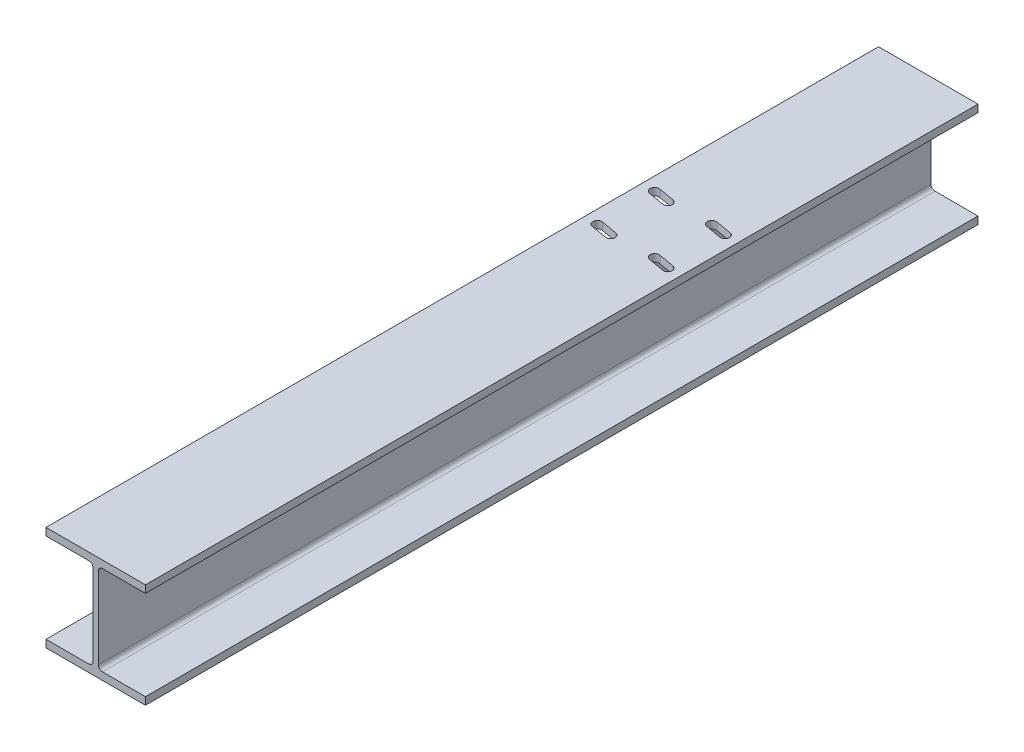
ISO-10303-21;
HEADER;
FILE_DESCRIPTION(('STEP AP214'),'2;1');
FILE_NAME('part.step','',(''),(''),'','','');
FILE_SCHEMA(('AUTOMOTIVE_DESIGN { 1 0 10303 214 1 1 1 1 }'));
ENDSEC;
DATA;
#1=APPLICATION_CONTEXT('core data for automotive mechanical design processes');
#2=APPLICATION_PROTOCOL_DEFINITION('international standard','automotive_design',2000,#1);
#3=PRODUCT_CONTEXT('',#1,'mechanical');
#4=PRODUCT('Part','Part','',(#3));
#5=PRODUCT_RELATED_PRODUCT_CATEGORY('part','',(#4));
#6=PRODUCT_DEFINITION_FORMATION('','',#4);
#7=PRODUCT_DEFINITION_CONTEXT('part definition',#1,'design');
#8=PRODUCT_DEFINITION('design','',#6,#7);
#9=PRODUCT_DEFINITION_SHAPE('','',#8);
#10=(LENGTH_UNIT() NAMED_UNIT(*) SI_UNIT(.MILLI.,.METRE.));
#11=(NAMED_UNIT(*) PLANE_ANGLE_UNIT() SI_UNIT($,.RADIAN.));
#12=(NAMED_UNIT(*) SI_UNIT($,.STERADIAN.) SOLID_ANGLE_UNIT());
#13=UNCERTAINTY_MEASURE_WITH_UNIT(LENGTH_MEASURE(1.E-05),#10,'distance_accuracy_value','');
#14=(GEOMETRIC_REPRESENTATION_CONTEXT(3) GLOBAL_UNCERTAINTY_ASSIGNED_CONTEXT((#13)) GLOBAL_UNIT_ASSIGNED_CONTEXT((#10,
#11,#12)) REPRESENTATION_CONTEXT('',''));
#15=CARTESIAN_POINT('',(0.,0.,0.));
#16=DIRECTION('',(0.,0.,1.));
#17=DIRECTION('',(1.,0.,0.));
#18=AXIS2_PLACEMENT_3D('',#15,#16,#17);
#19=CARTESIAN_POINT('',(154.432,0.,-646.51128));
#20=DIRECTION('',(0.,-1.,0.));
#21=DIRECTION('',(0.,0.,-1.));
#22=AXIS2_PLACEMENT_3D('',#19,#20,#21);
#23=PLANE('',#22);
#24=DIRECTION('',(1.,0.,0.));
#25=VECTOR('',#24,1.);
#26=CARTESIAN_POINT('',(154.432,0.,646.51128));
#27=LINE('',#26,#25);
#28=CARTESIAN_POINT('',(0.,0.,646.51128));
#29=VERTEX_POINT('',#28);
#30=CARTESIAN_POINT('',(154.432,0.,646.51128));
#31=VERTEX_POINT('',#30);
#32=EDGE_CURVE('E380',#29,#31,#27,.T.);
#33=ORIENTED_EDGE('',*,*,#32,.F.);
#34=DIRECTION('',(0.,0.,1.));
#35=VECTOR('',#34,1.);
#36=CARTESIAN_POINT('',(0.,0.,-646.51128));
#37=LINE('',#36,#35);
#38=CARTESIAN_POINT('',(0.,0.,-646.51128));
#39=VERTEX_POINT('',#38);
#40=EDGE_CURVE('E11',#39,#29,#37,.T.);
#41=ORIENTED_EDGE('',*,*,#40,.F.);
#42=DIRECTION('',(1.,0.,0.));
#43=VECTOR('',#42,1.);
#44=CARTESIAN_POINT('',(154.432,0.,-646.51128));
#45=LINE('',#44,#43);
#46=CARTESIAN_POINT('',(154.432,0.,-646.51128));
#47=VERTEX_POINT('',#46);
#48=EDGE_CURVE('E381',#39,#47,#45,.T.);
#49=ORIENTED_EDGE('',*,*,#48,.T.);
#50=DIRECTION('',(0.,0.,1.));
#51=VECTOR('',#50,1.);
#52=CARTESIAN_POINT('',(154.432,0.,-646.51128));
#53=LINE('',#52,#51);
#54=EDGE_CURVE('E42',#47,#31,#53,.T.);
#55=ORIENTED_EDGE('',*,*,#54,.T.);
#56=EDGE_LOOP('',(#33,#41,#49,#55));
#57=FACE_BOUND('',#56,.T.);
#58=ADVANCED_FACE('F39',(#57),#23,.T.);
#59=CARTESIAN_POINT('',(0.,0.,-646.51128));
#60=DIRECTION('',(-1.,0.,0.));
#61=DIRECTION('',(0.,-1.,0.));
#62=AXIS2_PLACEMENT_3D('',#59,#60,#61);
#63=PLANE('',#62);
#64=DIRECTION('',(0.,-1.,0.));
#65=VECTOR('',#64,1.);
#66=CARTESIAN_POINT('',(0.,0.,646.51128));
#67=LINE('',#66,#65);
#68=CARTESIAN_POINT('',(0.,11.557,646.51128));
#69=VERTEX_POINT('',#68);
#70=EDGE_CURVE('E385',#69,#29,#67,.T.);
#71=ORIENTED_EDGE('',*,*,#70,.F.);
#72=DIRECTION('',(0.,0.,1.));
#73=VECTOR('',#72,1.);
#74=CARTESIAN_POINT('',(0.,11.557,-646.51128));
#75=LINE('',#74,#73);
#76=CARTESIAN_POINT('',(0.,11.557,-646.51128));
#77=VERTEX_POINT('',#76);
#78=EDGE_CURVE('E47',#77,#69,#75,.T.);
#79=ORIENTED_EDGE('',*,*,#78,.F.);
#80=DIRECTION('',(0.,-1.,0.));
#81=VECTOR('',#80,1.);
#82=CARTESIAN_POINT('',(0.,0.,-646.51128));
#83=LINE('',#82,#81);
#84=EDGE_CURVE('E427',#77,#39,#83,.T.);
#85=ORIENTED_EDGE('',*,*,#84,.T.);
#86=ORIENTED_EDGE('',*,*,#40,.T.);
#87=EDGE_LOOP('',(#71,#79,#85,#86));
#88=FACE_BOUND('',#87,.T.);
#89=ADVANCED_FACE('F514',(#88),#63,.T.);
#90=CARTESIAN_POINT('',(0.,11.557,-646.51128));
#91=DIRECTION('',(0.,1.,0.));
#92=DIRECTION('',(-1.,0.,0.));
#93=AXIS2_PLACEMENT_3D('',#90,#91,#92);
#94=PLANE('',#93);
#95=DIRECTION('',(-1.,0.,0.));
#96=VECTOR('',#95,1.);
#97=CARTESIAN_POINT('',(0.,11.557,646.51128));
#98=LINE('',#97,#96);
#99=CARTESIAN_POINT('',(66.802,11.557,646.51128));
#100=VERTEX_POINT('',#99);
#101=EDGE_CURVE('E471',#100,#69,#98,.T.);
#102=ORIENTED_EDGE('',*,*,#101,.F.);
#103=DIRECTION('',(0.,0.,1.));
#104=VECTOR('',#103,1.);
#105=CARTESIAN_POINT('',(66.802,11.557,-646.51128));
#106=LINE('',#105,#104);
#107=CARTESIAN_POINT('',(66.802,11.557,-646.51128));
#108=VERTEX_POINT('',#107);
#109=EDGE_CURVE('E477',#108,#100,#106,.T.);
#110=ORIENTED_EDGE('',*,*,#109,.F.);
#111=DIRECTION('',(-1.,0.,0.));
#112=VECTOR('',#111,1.);
#113=CARTESIAN_POINT('',(0.,11.557,-646.51128));
#114=LINE('',#113,#112);
#115=EDGE_CURVE('E424',#108,#77,#114,.T.);
#116=ORIENTED_EDGE('',*,*,#115,.T.);
#117=ORIENTED_EDGE('',*,*,#78,.T.);
#118=EDGE_LOOP('',(#102,#110,#116,#117));
#119=FACE_BOUND('',#118,.T.);
#120=ADVANCED_FACE('F566',(#119),#94,.T.);
#121=CARTESIAN_POINT('',(66.802,17.907,-646.51128));
#122=DIRECTION('',(0.,0.,1.));
#123=DIRECTION('',(1.,0.,0.));
#124=AXIS2_PLACEMENT_3D('',#121,#122,#123);
#125=CYLINDRICAL_SURFACE('',#124,6.35);
#126=CARTESIAN_POINT('',(66.802,17.907,646.51128));
#127=DIRECTION('',(0.,0.,-1.));
#128=DIRECTION('',(1.,0.,0.));
#129=AXIS2_PLACEMENT_3D('',#126,#127,#128);
#130=CIRCLE('',#129,6.35);
#131=CARTESIAN_POINT('',(73.152,17.907,646.51128));
#132=VERTEX_POINT('',#131);
#133=EDGE_CURVE('E468',#132,#100,#130,.T.);
#134=ORIENTED_EDGE('',*,*,#133,.F.);
#135=DIRECTION('',(0.,0.,1.));
#136=VECTOR('',#135,1.);
#137=CARTESIAN_POINT('',(73.152,17.907,-646.51128));
#138=LINE('',#137,#136);
#139=CARTESIAN_POINT('',(73.152,17.907,-646.51128));
#140=VERTEX_POINT('',#139);
#141=EDGE_CURVE('E479',#140,#132,#138,.T.);
#142=ORIENTED_EDGE('',*,*,#141,.F.);
#143=CARTESIAN_POINT('',(66.802,17.907,-646.51128));
#144=DIRECTION('',(0.,0.,-1.));
#145=DIRECTION('',(1.,0.,0.));
#146=AXIS2_PLACEMENT_3D('',#143,#144,#145);
#147=CIRCLE('',#146,6.35);
#148=EDGE_CURVE('E421',#140,#108,#147,.T.);
#149=ORIENTED_EDGE('',*,*,#148,.T.);
#150=ORIENTED_EDGE('',*,*,#109,.T.);
#151=EDGE_LOOP('',(#134,#142,#149,#150));
#152=FACE_BOUND('',#151,.T.);
#153=ADVANCED_FACE('F564',(#152),#125,.F.);
#154=CARTESIAN_POINT('',(73.152,17.907,-646.51128));
#155=DIRECTION('',(-1.,0.,0.));
#156=DIRECTION('',(0.,-1.,0.));
#157=AXIS2_PLACEMENT_3D('',#154,#155,#156);
#158=PLANE('',#157);
#159=DIRECTION('',(0.,-1.,0.));
#160=VECTOR('',#159,1.);
#161=CARTESIAN_POINT('',(73.152,17.907,646.51128));
#162=LINE('',#161,#160);
#163=CARTESIAN_POINT('',(73.152,144.145,646.51128));
#164=VERTEX_POINT('',#163);
#165=EDGE_CURVE('E465',#164,#132,#162,.T.);
#166=ORIENTED_EDGE('',*,*,#165,.F.);
#167=DIRECTION('',(0.,0.,1.));
#168=VECTOR('',#167,1.);
#169=CARTESIAN_POINT('',(73.152,144.145,-646.51128));
#170=LINE('',#169,#168);
#171=CARTESIAN_POINT('',(73.152,144.145,-646.51128));
#172=VERTEX_POINT('',#171);
#173=EDGE_CURVE('E481',#172,#164,#170,.T.);
#174=ORIENTED_EDGE('',*,*,#173,.F.);
#175=DIRECTION('',(0.,-1.,0.));
#176=VECTOR('',#175,1.);
#177=CARTESIAN_POINT('',(73.152,17.907,-646.51128));
#178=LINE('',#177,#176);
#179=EDGE_CURVE('E418',#172,#140,#178,.T.);
#180=ORIENTED_EDGE('',*,*,#179,.T.);
#181=ORIENTED_EDGE('',*,*,#141,.T.);
#182=EDGE_LOOP('',(#166,#174,#180,#181));
#183=FACE_BOUND('',#182,.T.);
#184=ADVANCED_FACE('F560',(#183),#158,.T.);
#185=CARTESIAN_POINT('',(66.802,144.145,-646.51128));
#186=DIRECTION('',(0.,0.,1.));
#187=DIRECTION('',(1.,0.,0.));
#188=AXIS2_PLACEMENT_3D('',#185,#186,#187);
#189=CYLINDRICAL_SURFACE('',#188,6.34999999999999);
#190=CARTESIAN_POINT('',(66.802,144.145,646.51128));
#191=DIRECTION('',(0.,0.,-1.));
#192=DIRECTION('',(1.,0.,0.));
#193=AXIS2_PLACEMENT_3D('',#190,#191,#192);
#194=CIRCLE('',#193,6.34999999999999);
#195=CARTESIAN_POINT('',(66.802,150.495,646.51128));
#196=VERTEX_POINT('',#195);
#197=EDGE_CURVE('E462',#196,#164,#194,.T.);
#198=ORIENTED_EDGE('',*,*,#197,.F.);
#199=DIRECTION('',(0.,0.,1.));
#200=VECTOR('',#199,1.);
#201=CARTESIAN_POINT('',(66.802,150.495,-646.51128));
#202=LINE('',#201,#200);
#203=CARTESIAN_POINT('',(66.802,150.495,-646.51128));
#204=VERTEX_POINT('',#203);
#205=EDGE_CURVE('E483',#204,#196,#202,.T.);
#206=ORIENTED_EDGE('',*,*,#205,.F.);
#207=CARTESIAN_POINT('',(66.802,144.145,-646.51128));
#208=DIRECTION('',(0.,0.,-1.));
#209=DIRECTION('',(1.,0.,0.));
#210=AXIS2_PLACEMENT_3D('',#207,#208,#209);
#211=CIRCLE('',#210,6.34999999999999);
#212=EDGE_CURVE('E415',#204,#172,#211,.T.);
#213=ORIENTED_EDGE('',*,*,#212,.T.);
#214=ORIENTED_EDGE('',*,*,#173,.T.);
#215=EDGE_LOOP('',(#198,#206,#213,#214));
#216=FACE_BOUND('',#215,.T.);
#217=ADVANCED_FACE('F556',(#216),#189,.F.);
#218=CARTESIAN_POINT('',(66.802,150.495,-646.51128));
#219=DIRECTION('',(0.,-1.,0.));
#220=DIRECTION('',(0.,0.,-1.));
#221=AXIS2_PLACEMENT_3D('',#218,#219,#220);
#222=PLANE('',#221);
#223=DIRECTION('',(-0.984808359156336,0.,-0.173644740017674));
#224=VECTOR('',#223,1.);
#225=CARTESIAN_POINT('',(46.4792036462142,150.495,-280.876161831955));
#226=LINE('',#225,#224);
#227=CARTESIAN_POINT('',(46.4792036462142,150.495,-280.876161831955));
#228=VERTEX_POINT('',#227);
#229=CARTESIAN_POINT('',(21.4650713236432,150.495,-285.286738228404));
#230=VERTEX_POINT('',#229);
#231=EDGE_CURVE('E340',#228,#230,#226,.T.);
#232=ORIENTED_EDGE('',*,*,#231,.T.);
#233=CARTESIAN_POINT('',(20.2587786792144,150.495,-278.445373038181));
#234=DIRECTION('',(0.,-1.,0.));
#235=DIRECTION('',(0.,0.,-1.));
#236=AXIS2_PLACEMENT_3D('',#233,#234,#235);
#237=CIRCLE('',#236,6.94690000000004);
#238=CARTESIAN_POINT('',(19.0524860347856,150.495,-271.604007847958));
#239=VERTEX_POINT('',#238);
#240=EDGE_CURVE('E293',#230,#239,#237,.F.);
#241=ORIENTED_EDGE('',*,*,#240,.T.);
#242=DIRECTION('',(0.984808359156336,0.,0.173644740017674));
#243=VECTOR('',#242,1.);
#244=CARTESIAN_POINT('',(44.0666183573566,150.495,-267.193431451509));
#245=LINE('',#244,#243);
#246=CARTESIAN_POINT('',(44.0666183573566,150.495,-267.193431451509));
#247=VERTEX_POINT('',#246);
#248=EDGE_CURVE('E319',#239,#247,#245,.T.);
#249=ORIENTED_EDGE('',*,*,#248,.T.);
#250=CARTESIAN_POINT('',(45.2729110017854,150.495,-274.034796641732));
#251=DIRECTION('',(0.,-1.,0.));
#252=DIRECTION('',(0.,0.,-1.));
#253=AXIS2_PLACEMENT_3D('',#250,#251,#252);
#254=CIRCLE('',#253,6.94690000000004);
#255=EDGE_CURVE('E322',#247,#228,#254,.F.);
#256=ORIENTED_EDGE('',*,*,#255,.T.);
#257=EDGE_LOOP('',(#232,#241,#249,#256));
#258=FACE_BOUND('',#257,.T.);
#259=DIRECTION('',(-0.984808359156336,0.,-0.173644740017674));
#260=VECTOR('',#259,1.);
#261=CARTESIAN_POINT('',(46.4795139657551,150.495,-191.976161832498));
#262=LINE('',#261,#260);
#263=CARTESIAN_POINT('',(46.4795139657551,150.495,-191.976161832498));
#264=VERTEX_POINT('',#263);
#265=CARTESIAN_POINT('',(21.4653816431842,150.495,-196.386738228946));
#266=VERTEX_POINT('',#265);
#267=EDGE_CURVE('E372',#264,#266,#262,.T.);
#268=ORIENTED_EDGE('',*,*,#267,.T.);
#269=CARTESIAN_POINT('',(20.2590889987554,150.495,-189.545373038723));
#270=DIRECTION('',(0.,-1.,0.));
#271=DIRECTION('',(0.,0.,-1.));
#272=AXIS2_PLACEMENT_3D('',#269,#270,#271);
#273=CIRCLE('',#272,6.94690000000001);
#274=CARTESIAN_POINT('',(19.0527963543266,150.495,-182.7040078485));
#275=VERTEX_POINT('',#274);
#276=EDGE_CURVE('E348',#266,#275,#273,.F.);
#277=ORIENTED_EDGE('',*,*,#276,.T.);
#278=DIRECTION('',(0.984808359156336,0.,0.173644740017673));
#279=VECTOR('',#278,1.);
#280=CARTESIAN_POINT('',(44.0669286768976,150.495,-178.293431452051));
#281=LINE('',#280,#279);
#282=CARTESIAN_POINT('',(44.0669286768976,150.495,-178.293431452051));
#283=VERTEX_POINT('',#282);
#284=EDGE_CURVE('E351',#275,#283,#281,.T.);
#285=ORIENTED_EDGE('',*,*,#284,.T.);
#286=CARTESIAN_POINT('',(45.2732213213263,150.495,-185.134796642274));
#287=DIRECTION('',(0.,-1.,0.));
#288=DIRECTION('',(0.,0.,-1.));
#289=AXIS2_PLACEMENT_3D('',#286,#287,#288);
#290=CIRCLE('',#289,6.94690000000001);
#291=EDGE_CURVE('E354',#283,#264,#290,.F.);
#292=ORIENTED_EDGE('',*,*,#291,.T.);
#293=EDGE_LOOP('',(#268,#277,#285,#292));
#294=FACE_BOUND('',#293,.T.);
#295=DIRECTION('',(1.,0.,0.));
#296=VECTOR('',#295,1.);
#297=CARTESIAN_POINT('',(66.802,150.495,646.51128));
#298=LINE('',#297,#296);
#299=CARTESIAN_POINT('',(0.,150.495,646.51128));
#300=VERTEX_POINT('',#299);
#301=EDGE_CURVE('E459',#300,#196,#298,.T.);
#302=ORIENTED_EDGE('',*,*,#301,.F.);
#303=DIRECTION('',(0.,0.,1.));
#304=VECTOR('',#303,1.);
#305=CARTESIAN_POINT('',(0.,150.495,-646.51128));
#306=LINE('',#305,#304);
#307=CARTESIAN_POINT('',(0.,150.495,-646.51128));
#308=VERTEX_POINT('',#307);
#309=EDGE_CURVE('E485',#308,#300,#306,.T.);
#310=ORIENTED_EDGE('',*,*,#309,.F.);
#311=DIRECTION('',(1.,0.,0.));
#312=VECTOR('',#311,1.);
#313=CARTESIAN_POINT('',(66.802,150.495,-646.51128));
#314=LINE('',#313,#312);
#315=EDGE_CURVE('E412',#308,#204,#314,.T.);
#316=ORIENTED_EDGE('',*,*,#315,.T.);
#317=ORIENTED_EDGE('',*,*,#205,.T.);
#318=EDGE_LOOP('',(#302,#310,#316,#317));
#319=FACE_BOUND('',#318,.T.);
#320=ADVANCED_FACE('F552',(#258,#294,#319),#222,.T.);
#321=CARTESIAN_POINT('',(0.,150.495,-646.51128));
#322=DIRECTION('',(-1.,0.,0.));
#323=DIRECTION('',(0.,-1.,0.));
#324=AXIS2_PLACEMENT_3D('',#321,#322,#323);
#325=PLANE('',#324);
#326=DIRECTION('',(0.,-1.,0.));
#327=VECTOR('',#326,1.);
#328=CARTESIAN_POINT('',(0.,150.495,646.51128));
#329=LINE('',#328,#327);
#330=CARTESIAN_POINT('',(0.,162.052,646.51128));
#331=VERTEX_POINT('',#330);
#332=EDGE_CURVE('E456',#331,#300,#329,.T.);
#333=ORIENTED_EDGE('',*,*,#332,.F.);
#334=DIRECTION('',(0.,0.,1.));
#335=VECTOR('',#334,1.);
#336=CARTESIAN_POINT('',(0.,162.052,-646.51128));
#337=LINE('',#336,#335);
#338=CARTESIAN_POINT('',(0.,162.052,-646.51128));
#339=VERTEX_POINT('',#338);
#340=EDGE_CURVE('E487',#339,#331,#337,.T.);
#341=ORIENTED_EDGE('',*,*,#340,.F.);
#342=DIRECTION('',(0.,-1.,0.));
#343=VECTOR('',#342,1.);
#344=CARTESIAN_POINT('',(0.,150.495,-646.51128));
#345=LINE('',#344,#343);
#346=EDGE_CURVE('E409',#339,#308,#345,.T.);
#347=ORIENTED_EDGE('',*,*,#346,.T.);
#348=ORIENTED_EDGE('',*,*,#309,.T.);
#349=EDGE_LOOP('',(#333,#341,#347,#348));
#350=FACE_BOUND('',#349,.T.);
#351=ADVANCED_FACE('F548',(#350),#325,.T.);
#352=CARTESIAN_POINT('',(0.,162.052,-646.51128));
#353=DIRECTION('',(0.,1.,0.));
#354=DIRECTION('',(0.,0.,1.));
#355=AXIS2_PLACEMENT_3D('',#352,#353,#354);
#356=PLANE('',#355);
#357=CARTESIAN_POINT('',(134.173221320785,162.052,-185.135106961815));
#358=DIRECTION('',(0.,1.,0.));
#359=DIRECTION('',(0.,0.,1.));
#360=AXIS2_PLACEMENT_3D('',#357,#358,#359);
#361=CIRCLE('',#360,6.94690000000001);
#362=CARTESIAN_POINT('',(132.966928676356,162.052,-178.293741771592));
#363=VERTEX_POINT('',#362);
#364=CARTESIAN_POINT('',(135.379513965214,162.052,-191.976472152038));
#365=VERTEX_POINT('',#364);
#366=EDGE_CURVE('E55',#363,#365,#361,.T.);
#367=ORIENTED_EDGE('',*,*,#366,.F.);
#368=DIRECTION('',(0.984808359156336,0.,0.173644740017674));
#369=VECTOR('',#368,1.);
#370=CARTESIAN_POINT('',(132.966928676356,162.052,-178.293741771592));
#371=LINE('',#370,#369);
#372=CARTESIAN_POINT('',(107.952796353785,162.052,-182.704318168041));
#373=VERTEX_POINT('',#372);
#374=EDGE_CURVE('E258',#373,#363,#371,.T.);
#375=ORIENTED_EDGE('',*,*,#374,.F.);
#376=CARTESIAN_POINT('',(109.159088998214,162.052,-189.545683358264));
#377=DIRECTION('',(0.,1.,0.));
#378=DIRECTION('',(0.,0.,1.));
#379=AXIS2_PLACEMENT_3D('',#376,#377,#378);
#380=CIRCLE('',#379,6.94690000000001);
#381=CARTESIAN_POINT('',(110.365381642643,162.052,-196.387048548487));
#382=VERTEX_POINT('',#381);
#383=EDGE_CURVE('E266',#382,#373,#380,.T.);
#384=ORIENTED_EDGE('',*,*,#383,.F.);
#385=DIRECTION('',(-0.984808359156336,0.,-0.173644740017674));
#386=VECTOR('',#385,1.);
#387=CARTESIAN_POINT('',(135.379513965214,162.052,-191.976472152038));
#388=LINE('',#387,#386);
#389=EDGE_CURVE('E271',#365,#382,#388,.T.);
#390=ORIENTED_EDGE('',*,*,#389,.F.);
#391=EDGE_LOOP('',(#367,#375,#384,#390));
#392=FACE_BOUND('',#391,.T.);
#393=CARTESIAN_POINT('',(134.172911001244,162.052,-274.035106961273));
#394=DIRECTION('',(0.,1.,0.));
#395=DIRECTION('',(0.,0.,1.));
#396=AXIS2_PLACEMENT_3D('',#393,#394,#395);
#397=CIRCLE('',#396,6.94690000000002);
#398=CARTESIAN_POINT('',(132.966618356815,162.052,-267.19374177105));
#399=VERTEX_POINT('',#398);
#400=CARTESIAN_POINT('',(135.379203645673,162.052,-280.876472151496));
#401=VERTEX_POINT('',#400);
#402=EDGE_CURVE('E300',#399,#401,#397,.T.);
#403=ORIENTED_EDGE('',*,*,#402,.F.);
#404=DIRECTION('',(0.984808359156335,0.,0.173644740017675));
#405=VECTOR('',#404,1.);
#406=CARTESIAN_POINT('',(132.966618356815,162.052,-267.19374177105));
#407=LINE('',#406,#405);
#408=CARTESIAN_POINT('',(107.952486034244,162.052,-271.604318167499));
#409=VERTEX_POINT('',#408);
#410=EDGE_CURVE('E290',#409,#399,#407,.T.);
#411=ORIENTED_EDGE('',*,*,#410,.F.);
#412=CARTESIAN_POINT('',(109.158778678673,162.052,-278.445683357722));
#413=DIRECTION('',(0.,1.,0.));
#414=DIRECTION('',(0.,0.,1.));
#415=AXIS2_PLACEMENT_3D('',#412,#413,#414);
#416=CIRCLE('',#415,6.94689999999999);
#417=CARTESIAN_POINT('',(110.365071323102,162.052,-285.287048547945));
#418=VERTEX_POINT('',#417);
#419=EDGE_CURVE('E294',#418,#409,#416,.T.);
#420=ORIENTED_EDGE('',*,*,#419,.F.);
#421=DIRECTION('',(-0.984808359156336,0.,-0.173644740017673));
#422=VECTOR('',#421,1.);
#423=CARTESIAN_POINT('',(135.379203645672,162.052,-280.876472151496));
#424=LINE('',#423,#422);
#425=EDGE_CURVE('E297',#401,#418,#424,.T.);
#426=ORIENTED_EDGE('',*,*,#425,.F.);
#427=EDGE_LOOP('',(#403,#411,#420,#426));
#428=FACE_BOUND('',#427,.T.);
#429=DIRECTION('',(-0.984808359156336,0.,-0.173644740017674));
#430=VECTOR('',#429,1.);
#431=CARTESIAN_POINT('',(46.4792036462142,162.052,-280.876161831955));
#432=LINE('',#431,#430);
#433=CARTESIAN_POINT('',(46.4792036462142,162.052,-280.876161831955));
#434=VERTEX_POINT('',#433);
#435=CARTESIAN_POINT('',(21.4650713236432,162.052,-285.286738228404));
#436=VERTEX_POINT('',#435);
#437=EDGE_CURVE('E328',#434,#436,#432,.T.);
#438=ORIENTED_EDGE('',*,*,#437,.F.);
#439=CARTESIAN_POINT('',(45.2729110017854,162.052,-274.034796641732));
#440=DIRECTION('',(0.,1.,0.));
#441=DIRECTION('',(0.,0.,1.));
#442=AXIS2_PLACEMENT_3D('',#439,#440,#441);
#443=CIRCLE('',#442,6.94690000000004);
#444=CARTESIAN_POINT('',(44.0666183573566,162.052,-267.193431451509));
#445=VERTEX_POINT('',#444);
#446=EDGE_CURVE('E325',#445,#434,#443,.T.);
#447=ORIENTED_EDGE('',*,*,#446,.F.);
#448=DIRECTION('',(0.984808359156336,0.,0.173644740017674));
#449=VECTOR('',#448,1.);
#450=CARTESIAN_POINT('',(44.0666183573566,162.052,-267.193431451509));
#451=LINE('',#450,#449);
#452=CARTESIAN_POINT('',(19.0524860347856,162.052,-271.604007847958));
#453=VERTEX_POINT('',#452);
#454=EDGE_CURVE('E334',#453,#445,#451,.T.);
#455=ORIENTED_EDGE('',*,*,#454,.F.);
#456=CARTESIAN_POINT('',(20.2587786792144,162.052,-278.445373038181));
#457=DIRECTION('',(0.,1.,0.));
#458=DIRECTION('',(0.,0.,1.));
#459=AXIS2_PLACEMENT_3D('',#456,#457,#458);
#460=CIRCLE('',#459,6.94690000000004);
#461=EDGE_CURVE('E331',#436,#453,#460,.T.);
#462=ORIENTED_EDGE('',*,*,#461,.F.);
#463=EDGE_LOOP('',(#438,#447,#455,#462));
#464=FACE_BOUND('',#463,.T.);
#465=DIRECTION('',(-0.984808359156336,0.,-0.173644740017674));
#466=VECTOR('',#465,1.);
#467=CARTESIAN_POINT('',(46.4795139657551,162.052,-191.976161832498));
#468=LINE('',#467,#466);
#469=CARTESIAN_POINT('',(46.4795139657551,162.052,-191.976161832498));
#470=VERTEX_POINT('',#469);
#471=CARTESIAN_POINT('',(21.4653816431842,162.052,-196.386738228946));
#472=VERTEX_POINT('',#471);
#473=EDGE_CURVE('E360',#470,#472,#468,.T.);
#474=ORIENTED_EDGE('',*,*,#473,.F.);
#475=CARTESIAN_POINT('',(45.2732213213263,162.052,-185.134796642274));
#476=DIRECTION('',(0.,1.,0.));
#477=DIRECTION('',(0.,0.,1.));
#478=AXIS2_PLACEMENT_3D('',#475,#476,#477);
#479=CIRCLE('',#478,6.94690000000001);
#480=CARTESIAN_POINT('',(44.0669286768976,162.052,-178.293431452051));
#481=VERTEX_POINT('',#480);
#482=EDGE_CURVE('E357',#481,#470,#479,.T.);
#483=ORIENTED_EDGE('',*,*,#482,.F.);
#484=DIRECTION('',(0.984808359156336,0.,0.173644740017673));
#485=VECTOR('',#484,1.);
#486=CARTESIAN_POINT('',(44.0669286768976,162.052,-178.293431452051));
#487=LINE('',#486,#485);
#488=CARTESIAN_POINT('',(19.0527963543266,162.052,-182.7040078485));
#489=VERTEX_POINT('',#488);
#490=EDGE_CURVE('E366',#489,#481,#487,.T.);
#491=ORIENTED_EDGE('',*,*,#490,.F.);
#492=CARTESIAN_POINT('',(20.2590889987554,162.052,-189.545373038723));
#493=DIRECTION('',(0.,1.,0.));
#494=DIRECTION('',(0.,0.,1.));
#495=AXIS2_PLACEMENT_3D('',#492,#493,#494);
#496=CIRCLE('',#495,6.94690000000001);
#497=EDGE_CURVE('E363',#472,#489,#496,.T.);
#498=ORIENTED_EDGE('',*,*,#497,.F.);
#499=EDGE_LOOP('',(#474,#483,#491,#498));
#500=FACE_BOUND('',#499,.T.);
#501=DIRECTION('',(-1.,0.,0.));
#502=VECTOR('',#501,1.);
#503=CARTESIAN_POINT('',(0.,162.052,646.51128));
#504=LINE('',#503,#502);
#505=CARTESIAN_POINT('',(154.432,162.052,646.51128));
#506=VERTEX_POINT('',#505);
#507=EDGE_CURVE('E453',#506,#331,#504,.T.);
#508=ORIENTED_EDGE('',*,*,#507,.F.);
#509=DIRECTION('',(0.,0.,1.));
#510=VECTOR('',#509,1.);
#511=CARTESIAN_POINT('',(154.432,162.052,-646.51128));
#512=LINE('',#511,#510);
#513=CARTESIAN_POINT('',(154.432,162.052,-646.51128));
#514=VERTEX_POINT('',#513);
#515=EDGE_CURVE('E489',#514,#506,#512,.T.);
#516=ORIENTED_EDGE('',*,*,#515,.F.);
#517=DIRECTION('',(-1.,0.,0.));
#518=VECTOR('',#517,1.);
#519=CARTESIAN_POINT('',(0.,162.052,-646.51128));
#520=LINE('',#519,#518);
#521=EDGE_CURVE('E406',#514,#339,#520,.T.);
#522=ORIENTED_EDGE('',*,*,#521,.T.);
#523=ORIENTED_EDGE('',*,*,#340,.T.);
#524=EDGE_LOOP('',(#508,#516,#522,#523));
#525=FACE_BOUND('',#524,.T.);
#526=ADVANCED_FACE('F269',(#392,#428,#464,#500,#525),#356,.T.);
#527=CARTESIAN_POINT('',(154.432,162.052,-646.51128));
#528=DIRECTION('',(1.,0.,0.));
#529=DIRECTION('',(0.,0.,-1.));
#530=AXIS2_PLACEMENT_3D('',#527,#528,#529);
#531=PLANE('',#530);
#532=DIRECTION('',(0.,1.,0.));
#533=VECTOR('',#532,1.);
#534=CARTESIAN_POINT('',(154.432,162.052,646.51128));
#535=LINE('',#534,#533);
#536=CARTESIAN_POINT('',(154.432,150.495,646.51128));
#537=VERTEX_POINT('',#536);
#538=EDGE_CURVE('E450',#537,#506,#535,.T.);
#539=ORIENTED_EDGE('',*,*,#538,.F.);
#540=DIRECTION('',(0.,0.,1.));
#541=VECTOR('',#540,1.);
#542=CARTESIAN_POINT('',(154.432,150.495,-646.51128));
#543=LINE('',#542,#541);
#544=CARTESIAN_POINT('',(154.432,150.495,-646.51128));
#545=VERTEX_POINT('',#544);
#546=EDGE_CURVE('E491',#545,#537,#543,.T.);
#547=ORIENTED_EDGE('',*,*,#546,.F.);
#548=DIRECTION('',(0.,1.,0.));
#549=VECTOR('',#548,1.);
#550=CARTESIAN_POINT('',(154.432,162.052,-646.51128));
#551=LINE('',#550,#549);
#552=EDGE_CURVE('E403',#545,#514,#551,.T.);
#553=ORIENTED_EDGE('',*,*,#552,.T.);
#554=ORIENTED_EDGE('',*,*,#515,.T.);
#555=EDGE_LOOP('',(#539,#547,#553,#554));
#556=FACE_BOUND('',#555,.T.);
#557=ADVANCED_FACE('F541',(#556),#531,.T.);
#558=CARTESIAN_POINT('',(154.432,150.495,-646.51128));
#559=DIRECTION('',(0.,-1.,0.));
#560=DIRECTION('',(0.,0.,-1.));
#561=AXIS2_PLACEMENT_3D('',#558,#559,#560);
#562=PLANE('',#561);
#563=CARTESIAN_POINT('',(134.173221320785,150.495,-185.135106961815));
#564=DIRECTION('',(0.,-1.,0.));
#565=DIRECTION('',(0.,0.,-1.));
#566=AXIS2_PLACEMENT_3D('',#563,#564,#565);
#567=CIRCLE('',#566,6.94690000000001);
#568=CARTESIAN_POINT('',(132.966928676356,150.495,-178.293741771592));
#569=VERTEX_POINT('',#568);
#570=CARTESIAN_POINT('',(135.379513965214,150.495,-191.976472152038));
#571=VERTEX_POINT('',#570);
#572=EDGE_CURVE('E251',#569,#571,#567,.F.);
#573=ORIENTED_EDGE('',*,*,#572,.T.);
#574=DIRECTION('',(-0.984808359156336,0.,-0.173644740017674));
#575=VECTOR('',#574,1.);
#576=CARTESIAN_POINT('',(135.379513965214,150.495,-191.976472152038));
#577=LINE('',#576,#575);
#578=CARTESIAN_POINT('',(110.365381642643,150.495,-196.387048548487));
#579=VERTEX_POINT('',#578);
#580=EDGE_CURVE('E274',#571,#579,#577,.T.);
#581=ORIENTED_EDGE('',*,*,#580,.T.);
#582=CARTESIAN_POINT('',(109.159088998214,150.495,-189.545683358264));
#583=DIRECTION('',(0.,-1.,0.));
#584=DIRECTION('',(0.,0.,-1.));
#585=AXIS2_PLACEMENT_3D('',#582,#583,#584);
#586=CIRCLE('',#585,6.94690000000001);
#587=CARTESIAN_POINT('',(107.952796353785,150.495,-182.704318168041));
#588=VERTEX_POINT('',#587);
#589=EDGE_CURVE('E254',#579,#588,#586,.F.);
#590=ORIENTED_EDGE('',*,*,#589,.T.);
#591=DIRECTION('',(0.984808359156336,0.,0.173644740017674));
#592=VECTOR('',#591,1.);
#593=CARTESIAN_POINT('',(132.966928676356,150.495,-178.293741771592));
#594=LINE('',#593,#592);
#595=EDGE_CURVE('E255',#588,#569,#594,.T.);
#596=ORIENTED_EDGE('',*,*,#595,.T.);
#597=EDGE_LOOP('',(#573,#581,#590,#596));
#598=FACE_BOUND('',#597,.T.);
#599=CARTESIAN_POINT('',(134.172911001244,150.495,-274.035106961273));
#600=DIRECTION('',(0.,-1.,0.));
#601=DIRECTION('',(0.,0.,-1.));
#602=AXIS2_PLACEMENT_3D('',#599,#600,#601);
#603=CIRCLE('',#602,6.94690000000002);
#604=CARTESIAN_POINT('',(132.966618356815,150.495,-267.19374177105));
#605=VERTEX_POINT('',#604);
#606=CARTESIAN_POINT('',(135.379203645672,150.495,-280.876472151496));
#607=VERTEX_POINT('',#606);
#608=EDGE_CURVE('E265',#605,#607,#603,.F.);
#609=ORIENTED_EDGE('',*,*,#608,.T.);
#610=DIRECTION('',(-0.984808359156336,0.,-0.173644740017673));
#611=VECTOR('',#610,1.);
#612=CARTESIAN_POINT('',(135.379203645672,150.495,-280.876472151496));
#613=LINE('',#612,#611);
#614=CARTESIAN_POINT('',(110.365071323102,150.495,-285.287048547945));
#615=VERTEX_POINT('',#614);
#616=EDGE_CURVE('E285',#607,#615,#613,.T.);
#617=ORIENTED_EDGE('',*,*,#616,.T.);
#618=CARTESIAN_POINT('',(109.158778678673,150.495,-278.445683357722));
#619=DIRECTION('',(0.,-1.,0.));
#620=DIRECTION('',(0.,0.,-1.));
#621=AXIS2_PLACEMENT_3D('',#618,#619,#620);
#622=CIRCLE('',#621,6.94689999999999);
#623=CARTESIAN_POINT('',(107.952486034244,150.495,-271.604318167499));
#624=VERTEX_POINT('',#623);
#625=EDGE_CURVE('E309',#615,#624,#622,.F.);
#626=ORIENTED_EDGE('',*,*,#625,.T.);
#627=DIRECTION('',(0.984808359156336,0.,0.173644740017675));
#628=VECTOR('',#627,1.);
#629=CARTESIAN_POINT('',(132.966618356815,150.495,-267.19374177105));
#630=LINE('',#629,#628);
#631=EDGE_CURVE('E305',#624,#605,#630,.T.);
#632=ORIENTED_EDGE('',*,*,#631,.T.);
#633=EDGE_LOOP('',(#609,#617,#626,#632));
#634=FACE_BOUND('',#633,.T.);
#635=DIRECTION('',(1.,0.,0.));
#636=VECTOR('',#635,1.);
#637=CARTESIAN_POINT('',(154.432,150.495,646.51128));
#638=LINE('',#637,#636);
#639=CARTESIAN_POINT('',(87.63,150.495,646.51128));
#640=VERTEX_POINT('',#639);
#641=EDGE_CURVE('E447',#640,#537,#638,.T.);
#642=ORIENTED_EDGE('',*,*,#641,.F.);
#643=DIRECTION('',(0.,0.,1.));
#644=VECTOR('',#643,1.);
#645=CARTESIAN_POINT('',(87.63,150.495,-646.51128));
#646=LINE('',#645,#644);
#647=CARTESIAN_POINT('',(87.63,150.495,-646.51128));
#648=VERTEX_POINT('',#647);
#649=EDGE_CURVE('E493',#648,#640,#646,.T.);
#650=ORIENTED_EDGE('',*,*,#649,.F.);
#651=DIRECTION('',(1.,0.,0.));
#652=VECTOR('',#651,1.);
#653=CARTESIAN_POINT('',(154.432,150.495,-646.51128));
#654=LINE('',#653,#652);
#655=EDGE_CURVE('E400',#648,#545,#654,.T.);
#656=ORIENTED_EDGE('',*,*,#655,.T.);
#657=ORIENTED_EDGE('',*,*,#546,.T.);
#658=EDGE_LOOP('',(#642,#650,#656,#657));
#659=FACE_BOUND('',#658,.T.);
#660=ADVANCED_FACE('F537',(#598,#634,#659),#562,.T.);
#661=CARTESIAN_POINT('',(87.63,144.145,-646.51128));
#662=DIRECTION('',(0.,0.,1.));
#663=DIRECTION('',(1.,0.,0.));
#664=AXIS2_PLACEMENT_3D('',#661,#662,#663);
#665=CYLINDRICAL_SURFACE('',#664,6.34999999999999);
#666=CARTESIAN_POINT('',(87.63,144.145,646.51128));
#667=DIRECTION('',(0.,0.,-1.));
#668=DIRECTION('',(1.,0.,0.));
#669=AXIS2_PLACEMENT_3D('',#666,#667,#668);
#670=CIRCLE('',#669,6.34999999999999);
#671=CARTESIAN_POINT('',(81.28,144.145,646.51128));
#672=VERTEX_POINT('',#671);
#673=EDGE_CURVE('E444',#672,#640,#670,.T.);
#674=ORIENTED_EDGE('',*,*,#673,.F.);
#675=DIRECTION('',(0.,0.,1.));
#676=VECTOR('',#675,1.);
#677=CARTESIAN_POINT('',(81.28,144.145,-646.51128));
#678=LINE('',#677,#676);
#679=CARTESIAN_POINT('',(81.28,144.145,-646.51128));
#680=VERTEX_POINT('',#679);
#681=EDGE_CURVE('E495',#680,#672,#678,.T.);
#682=ORIENTED_EDGE('',*,*,#681,.F.);
#683=CARTESIAN_POINT('',(87.63,144.145,-646.51128));
#684=DIRECTION('',(0.,0.,-1.));
#685=DIRECTION('',(1.,0.,0.));
#686=AXIS2_PLACEMENT_3D('',#683,#684,#685);
#687=CIRCLE('',#686,6.34999999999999);
#688=EDGE_CURVE('E397',#680,#648,#687,.T.);
#689=ORIENTED_EDGE('',*,*,#688,.T.);
#690=ORIENTED_EDGE('',*,*,#649,.T.);
#691=EDGE_LOOP('',(#674,#682,#689,#690));
#692=FACE_BOUND('',#691,.T.);
#693=ADVANCED_FACE('F533',(#692),#665,.F.);
#694=CARTESIAN_POINT('',(81.28,144.145,-646.51128));
#695=DIRECTION('',(1.,0.,0.));
#696=DIRECTION('',(0.,1.,0.));
#697=AXIS2_PLACEMENT_3D('',#694,#695,#696);
#698=PLANE('',#697);
#699=DIRECTION('',(0.,1.,0.));
#700=VECTOR('',#699,1.);
#701=CARTESIAN_POINT('',(81.28,144.145,646.51128));
#702=LINE('',#701,#700);
#703=CARTESIAN_POINT('',(81.28,17.907,646.51128));
#704=VERTEX_POINT('',#703);
#705=EDGE_CURVE('E441',#704,#672,#702,.T.);
#706=ORIENTED_EDGE('',*,*,#705,.F.);
#707=DIRECTION('',(0.,0.,1.));
#708=VECTOR('',#707,1.);
#709=CARTESIAN_POINT('',(81.28,17.907,-646.51128));
#710=LINE('',#709,#708);
#711=CARTESIAN_POINT('',(81.28,17.907,-646.51128));
#712=VERTEX_POINT('',#711);
#713=EDGE_CURVE('E497',#712,#704,#710,.T.);
#714=ORIENTED_EDGE('',*,*,#713,.F.);
#715=DIRECTION('',(0.,1.,0.));
#716=VECTOR('',#715,1.);
#717=CARTESIAN_POINT('',(81.28,144.145,-646.51128));
#718=LINE('',#717,#716);
#719=EDGE_CURVE('E394',#712,#680,#718,.T.);
#720=ORIENTED_EDGE('',*,*,#719,.T.);
#721=ORIENTED_EDGE('',*,*,#681,.T.);
#722=EDGE_LOOP('',(#706,#714,#720,#721));
#723=FACE_BOUND('',#722,.T.);
#724=ADVANCED_FACE('F529',(#723),#698,.T.);
#725=CARTESIAN_POINT('',(87.63,17.907,-646.51128));
#726=DIRECTION('',(0.,0.,1.));
#727=DIRECTION('',(1.,0.,0.));
#728=AXIS2_PLACEMENT_3D('',#725,#726,#727);
#729=CYLINDRICAL_SURFACE('',#728,6.34999999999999);
#730=CARTESIAN_POINT('',(87.63,17.907,646.51128));
#731=DIRECTION('',(0.,0.,-1.));
#732=DIRECTION('',(1.,0.,0.));
#733=AXIS2_PLACEMENT_3D('',#730,#731,#732);
#734=CIRCLE('',#733,6.34999999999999);
#735=CARTESIAN_POINT('',(87.63,11.557,646.51128));
#736=VERTEX_POINT('',#735);
#737=EDGE_CURVE('E438',#736,#704,#734,.T.);
#738=ORIENTED_EDGE('',*,*,#737,.F.);
#739=DIRECTION('',(0.,0.,1.));
#740=VECTOR('',#739,1.);
#741=CARTESIAN_POINT('',(87.63,11.557,-646.51128));
#742=LINE('',#741,#740);
#743=CARTESIAN_POINT('',(87.63,11.557,-646.51128));
#744=VERTEX_POINT('',#743);
#745=EDGE_CURVE('E499',#744,#736,#742,.T.);
#746=ORIENTED_EDGE('',*,*,#745,.F.);
#747=CARTESIAN_POINT('',(87.63,17.907,-646.51128));
#748=DIRECTION('',(0.,0.,-1.));
#749=DIRECTION('',(1.,0.,0.));
#750=AXIS2_PLACEMENT_3D('',#747,#748,#749);
#751=CIRCLE('',#750,6.34999999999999);
#752=EDGE_CURVE('E391',#744,#712,#751,.T.);
#753=ORIENTED_EDGE('',*,*,#752,.T.);
#754=ORIENTED_EDGE('',*,*,#713,.T.);
#755=EDGE_LOOP('',(#738,#746,#753,#754));
#756=FACE_BOUND('',#755,.T.);
#757=ADVANCED_FACE('F527',(#756),#729,.F.);
#758=CARTESIAN_POINT('',(87.63,11.557,-646.51128));
#759=DIRECTION('',(0.,1.,0.));
#760=DIRECTION('',(-1.,0.,0.));
#761=AXIS2_PLACEMENT_3D('',#758,#759,#760);
#762=PLANE('',#761);
#763=DIRECTION('',(-1.,0.,0.));
#764=VECTOR('',#763,1.);
#765=CARTESIAN_POINT('',(87.63,11.557,646.51128));
#766=LINE('',#765,#764);
#767=CARTESIAN_POINT('',(154.432,11.557,646.51128));
#768=VERTEX_POINT('',#767);
#769=EDGE_CURVE('E435',#768,#736,#766,.T.);
#770=ORIENTED_EDGE('',*,*,#769,.F.);
#771=DIRECTION('',(0.,0.,1.));
#772=VECTOR('',#771,1.);
#773=CARTESIAN_POINT('',(154.432,11.557,-646.51128));
#774=LINE('',#773,#772);
#775=CARTESIAN_POINT('',(154.432,11.557,-646.51128));
#776=VERTEX_POINT('',#775);
#777=EDGE_CURVE('E500',#776,#768,#774,.T.);
#778=ORIENTED_EDGE('',*,*,#777,.F.);
#779=DIRECTION('',(-1.,0.,0.));
#780=VECTOR('',#779,1.);
#781=CARTESIAN_POINT('',(87.63,11.557,-646.51128));
#782=LINE('',#781,#780);
#783=EDGE_CURVE('E388',#776,#744,#782,.T.);
#784=ORIENTED_EDGE('',*,*,#783,.T.);
#785=ORIENTED_EDGE('',*,*,#745,.T.);
#786=EDGE_LOOP('',(#770,#778,#784,#785));
#787=FACE_BOUND('',#786,.T.);
#788=ADVANCED_FACE('F523',(#787),#762,.T.);
#789=CARTESIAN_POINT('',(154.432,11.557,-646.51128));
#790=DIRECTION('',(1.,0.,0.));
#791=DIRECTION('',(0.,0.,-1.));
#792=AXIS2_PLACEMENT_3D('',#789,#790,#791);
#793=PLANE('',#792);
#794=DIRECTION('',(0.,1.,0.));
#795=VECTOR('',#794,1.);
#796=CARTESIAN_POINT('',(154.432,11.557,646.51128));
#797=LINE('',#796,#795);
#798=EDGE_CURVE('E432',#31,#768,#797,.T.);
#799=ORIENTED_EDGE('',*,*,#798,.F.);
#800=ORIENTED_EDGE('',*,*,#54,.F.);
#801=DIRECTION('',(0.,1.,0.));
#802=VECTOR('',#801,1.);
#803=CARTESIAN_POINT('',(154.432,11.557,-646.51128));
#804=LINE('',#803,#802);
#805=EDGE_CURVE('E384',#47,#776,#804,.T.);
#806=ORIENTED_EDGE('',*,*,#805,.T.);
#807=ORIENTED_EDGE('',*,*,#777,.T.);
#808=EDGE_LOOP('',(#799,#800,#806,#807));
#809=FACE_BOUND('',#808,.T.);
#810=ADVANCED_FACE('F508',(#809),#793,.T.);
#811=CARTESIAN_POINT('',(66.802,17.907,-646.51128));
#812=DIRECTION('',(0.,0.,1.));
#813=DIRECTION('',(1.,0.,0.));
#814=AXIS2_PLACEMENT_3D('',#811,#812,#813);
#815=PLANE('',#814);
#816=ORIENTED_EDGE('',*,*,#48,.F.);
#817=ORIENTED_EDGE('',*,*,#84,.F.);
#818=ORIENTED_EDGE('',*,*,#115,.F.);
#819=ORIENTED_EDGE('',*,*,#148,.F.);
#820=ORIENTED_EDGE('',*,*,#179,.F.);
#821=ORIENTED_EDGE('',*,*,#212,.F.);
#822=ORIENTED_EDGE('',*,*,#315,.F.);
#823=ORIENTED_EDGE('',*,*,#346,.F.);
#824=ORIENTED_EDGE('',*,*,#521,.F.);
#825=ORIENTED_EDGE('',*,*,#552,.F.);
#826=ORIENTED_EDGE('',*,*,#655,.F.);
#827=ORIENTED_EDGE('',*,*,#688,.F.);
#828=ORIENTED_EDGE('',*,*,#719,.F.);
#829=ORIENTED_EDGE('',*,*,#752,.F.);
#830=ORIENTED_EDGE('',*,*,#783,.F.);
#831=ORIENTED_EDGE('',*,*,#805,.F.);
#832=EDGE_LOOP('',(#816,#817,#818,#819,#820,#821,#822,#823,#824,#825,#826,#827,#828,#829,#830,#831));
#833=FACE_BOUND('',#832,.T.);
#834=ADVANCED_FACE('F517',(#833),#815,.F.);
#835=CARTESIAN_POINT('',(66.802,17.907,646.51128));
#836=DIRECTION('',(0.,0.,1.));
#837=DIRECTION('',(1.,0.,0.));
#838=AXIS2_PLACEMENT_3D('',#835,#836,#837);
#839=PLANE('',#838);
#840=ORIENTED_EDGE('',*,*,#32,.T.);
#841=ORIENTED_EDGE('',*,*,#798,.T.);
#842=ORIENTED_EDGE('',*,*,#769,.T.);
#843=ORIENTED_EDGE('',*,*,#737,.T.);
#844=ORIENTED_EDGE('',*,*,#705,.T.);
#845=ORIENTED_EDGE('',*,*,#673,.T.);
#846=ORIENTED_EDGE('',*,*,#641,.T.);
#847=ORIENTED_EDGE('',*,*,#538,.T.);
#848=ORIENTED_EDGE('',*,*,#507,.T.);
#849=ORIENTED_EDGE('',*,*,#332,.T.);
#850=ORIENTED_EDGE('',*,*,#301,.T.);
#851=ORIENTED_EDGE('',*,*,#197,.T.);
#852=ORIENTED_EDGE('',*,*,#165,.T.);
#853=ORIENTED_EDGE('',*,*,#133,.T.);
#854=ORIENTED_EDGE('',*,*,#101,.T.);
#855=ORIENTED_EDGE('',*,*,#70,.T.);
#856=EDGE_LOOP('',(#840,#841,#842,#843,#844,#845,#846,#847,#848,#849,#850,#851,#852,#853,#854,#855));
#857=FACE_BOUND('',#856,.T.);
#858=ADVANCED_FACE('F510',(#857),#839,.T.);
#859=CARTESIAN_POINT('',(46.4795139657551,-0.001000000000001,-191.976161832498));
#860=DIRECTION('',(0.173644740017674,0.,-0.984808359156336));
#861=DIRECTION('',(-0.984808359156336,0.,-0.173644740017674));
#862=AXIS2_PLACEMENT_3D('',#859,#860,#861);
#863=PLANE('',#862);
#864=DIRECTION('',(0.,1.,0.));
#865=VECTOR('',#864,1.);
#866=CARTESIAN_POINT('',(46.4795139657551,-0.001000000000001,-191.976161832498));
#867=LINE('',#866,#865);
#868=EDGE_CURVE('E368',#264,#470,#867,.T.);
#869=ORIENTED_EDGE('',*,*,#868,.T.);
#870=ORIENTED_EDGE('',*,*,#473,.T.);
#871=DIRECTION('',(0.,1.,0.));
#872=VECTOR('',#871,1.);
#873=CARTESIAN_POINT('',(21.4653816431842,-0.001000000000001,-196.386738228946));
#874=LINE('',#873,#872);
#875=EDGE_CURVE('E375',#266,#472,#874,.T.);
#876=ORIENTED_EDGE('',*,*,#875,.F.);
#877=ORIENTED_EDGE('',*,*,#267,.F.);
#878=EDGE_LOOP('',(#869,#870,#876,#877));
#879=FACE_BOUND('',#878,.T.);
#880=ADVANCED_FACE('F686',(#879),#863,.F.);
#881=CARTESIAN_POINT('',(20.2590889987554,-0.001000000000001,-189.545373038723));
#882=DIRECTION('',(0.,1.,0.));
#883=DIRECTION('',(0.,0.,1.));
#884=AXIS2_PLACEMENT_3D('',#881,#882,#883);
#885=CYLINDRICAL_SURFACE('',#884,6.94690000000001);
#886=ORIENTED_EDGE('',*,*,#875,.T.);
#887=ORIENTED_EDGE('',*,*,#497,.T.);
#888=DIRECTION('',(0.,1.,0.));
#889=VECTOR('',#888,1.);
#890=CARTESIAN_POINT('',(19.0527963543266,-0.001000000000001,-182.7040078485));
#891=LINE('',#890,#889);
#892=EDGE_CURVE('E373',#275,#489,#891,.T.);
#893=ORIENTED_EDGE('',*,*,#892,.F.);
#894=ORIENTED_EDGE('',*,*,#276,.F.);
#895=EDGE_LOOP('',(#886,#887,#893,#894));
#896=FACE_BOUND('',#895,.T.);
#897=ADVANCED_FACE('F715',(#896),#885,.F.);
#898=CARTESIAN_POINT('',(44.0669286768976,-0.001000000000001,-178.293431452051));
#899=DIRECTION('',(-0.173644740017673,0.,0.984808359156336));
#900=DIRECTION('',(0.984808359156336,0.,0.173644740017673));
#901=AXIS2_PLACEMENT_3D('',#898,#899,#900);
#902=PLANE('',#901);
#903=ORIENTED_EDGE('',*,*,#892,.T.);
#904=ORIENTED_EDGE('',*,*,#490,.T.);
#905=DIRECTION('',(0.,1.,0.));
#906=VECTOR('',#905,1.);
#907=CARTESIAN_POINT('',(44.0669286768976,-0.001000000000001,-178.293431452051));
#908=LINE('',#907,#906);
#909=EDGE_CURVE('E369',#283,#481,#908,.T.);
#910=ORIENTED_EDGE('',*,*,#909,.F.);
#911=ORIENTED_EDGE('',*,*,#284,.F.);
#912=EDGE_LOOP('',(#903,#904,#910,#911));
#913=FACE_BOUND('',#912,.T.);
#914=ADVANCED_FACE('F725',(#913),#902,.F.);
#915=CARTESIAN_POINT('',(45.2732213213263,-0.001000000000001,-185.134796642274));
#916=DIRECTION('',(0.,1.,0.));
#917=DIRECTION('',(0.,0.,1.));
#918=AXIS2_PLACEMENT_3D('',#915,#916,#917);
#919=CYLINDRICAL_SURFACE('',#918,6.94690000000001);
#920=ORIENTED_EDGE('',*,*,#909,.T.);
#921=ORIENTED_EDGE('',*,*,#482,.T.);
#922=ORIENTED_EDGE('',*,*,#868,.F.);
#923=ORIENTED_EDGE('',*,*,#291,.F.);
#924=EDGE_LOOP('',(#920,#921,#922,#923));
#925=FACE_BOUND('',#924,.T.);
#926=ADVANCED_FACE('F735',(#925),#919,.F.);
#927=CARTESIAN_POINT('',(46.4792036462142,-0.001000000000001,-280.876161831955));
#928=DIRECTION('',(0.173644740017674,0.,-0.984808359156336));
#929=DIRECTION('',(-0.984808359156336,0.,-0.173644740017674));
#930=AXIS2_PLACEMENT_3D('',#927,#928,#929);
#931=PLANE('',#930);
#932=DIRECTION('',(0.,1.,0.));
#933=VECTOR('',#932,1.);
#934=CARTESIAN_POINT('',(46.4792036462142,-0.001000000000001,-280.876161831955));
#935=LINE('',#934,#933);
#936=EDGE_CURVE('E336',#228,#434,#935,.T.);
#937=ORIENTED_EDGE('',*,*,#936,.T.);
#938=ORIENTED_EDGE('',*,*,#437,.T.);
#939=DIRECTION('',(0.,1.,0.));
#940=VECTOR('',#939,1.);
#941=CARTESIAN_POINT('',(21.4650713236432,-0.001000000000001,-285.286738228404));
#942=LINE('',#941,#940);
#943=EDGE_CURVE('E343',#230,#436,#942,.T.);
#944=ORIENTED_EDGE('',*,*,#943,.F.);
#945=ORIENTED_EDGE('',*,*,#231,.F.);
#946=EDGE_LOOP('',(#937,#938,#944,#945));
#947=FACE_BOUND('',#946,.T.);
#948=ADVANCED_FACE('F745',(#947),#931,.F.);
#949=CARTESIAN_POINT('',(20.2587786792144,-0.001000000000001,-278.445373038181));
#950=DIRECTION('',(0.,1.,0.));
#951=DIRECTION('',(0.,0.,1.));
#952=AXIS2_PLACEMENT_3D('',#949,#950,#951);
#953=CYLINDRICAL_SURFACE('',#952,6.94690000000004);
#954=ORIENTED_EDGE('',*,*,#943,.T.);
#955=ORIENTED_EDGE('',*,*,#461,.T.);
#956=DIRECTION('',(0.,1.,0.));
#957=VECTOR('',#956,1.);
#958=CARTESIAN_POINT('',(19.0524860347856,-0.001000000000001,-271.604007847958));
#959=LINE('',#958,#957);
#960=EDGE_CURVE('E341',#239,#453,#959,.T.);
#961=ORIENTED_EDGE('',*,*,#960,.F.);
#962=ORIENTED_EDGE('',*,*,#240,.F.);
#963=EDGE_LOOP('',(#954,#955,#961,#962));
#964=FACE_BOUND('',#963,.T.);
#965=ADVANCED_FACE('F755',(#964),#953,.F.);
#966=CARTESIAN_POINT('',(44.0666183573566,-0.001000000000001,-267.193431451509));
#967=DIRECTION('',(-0.173644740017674,0.,0.984808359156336));
#968=DIRECTION('',(0.984808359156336,0.,0.173644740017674));
#969=AXIS2_PLACEMENT_3D('',#966,#967,#968);
#970=PLANE('',#969);
#971=ORIENTED_EDGE('',*,*,#960,.T.);
#972=ORIENTED_EDGE('',*,*,#454,.T.);
#973=DIRECTION('',(0.,1.,0.));
#974=VECTOR('',#973,1.);
#975=CARTESIAN_POINT('',(44.0666183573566,-0.001000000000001,-267.193431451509));
#976=LINE('',#975,#974);
#977=EDGE_CURVE('E337',#247,#445,#976,.T.);
#978=ORIENTED_EDGE('',*,*,#977,.F.);
#979=ORIENTED_EDGE('',*,*,#248,.F.);
#980=EDGE_LOOP('',(#971,#972,#978,#979));
#981=FACE_BOUND('',#980,.T.);
#982=ADVANCED_FACE('F765',(#981),#970,.F.);
#983=CARTESIAN_POINT('',(45.2729110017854,-0.001000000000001,-274.034796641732));
#984=DIRECTION('',(0.,1.,0.));
#985=DIRECTION('',(0.,0.,1.));
#986=AXIS2_PLACEMENT_3D('',#983,#984,#985);
#987=CYLINDRICAL_SURFACE('',#986,6.94690000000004);
#988=ORIENTED_EDGE('',*,*,#977,.T.);
#989=ORIENTED_EDGE('',*,*,#446,.T.);
#990=ORIENTED_EDGE('',*,*,#936,.F.);
#991=ORIENTED_EDGE('',*,*,#255,.F.);
#992=EDGE_LOOP('',(#988,#989,#990,#991));
#993=FACE_BOUND('',#992,.T.);
#994=ADVANCED_FACE('F775',(#993),#987,.F.);
#995=CARTESIAN_POINT('',(134.172911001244,-0.001000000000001,-274.035106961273));
#996=DIRECTION('',(0.,1.,0.));
#997=DIRECTION('',(0.,0.,1.));
#998=AXIS2_PLACEMENT_3D('',#995,#996,#997);
#999=CYLINDRICAL_SURFACE('',#998,6.94690000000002);
#1000=DIRECTION('',(0.,1.,0.));
#1001=VECTOR('',#1000,1.);
#1002=CARTESIAN_POINT('',(132.966618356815,-0.001000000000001,-267.19374177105));
#1003=LINE('',#1002,#1001);
#1004=EDGE_CURVE('E308',#605,#399,#1003,.T.);
#1005=ORIENTED_EDGE('',*,*,#1004,.T.);
#1006=ORIENTED_EDGE('',*,*,#402,.T.);
#1007=DIRECTION('',(0.,1.,0.));
#1008=VECTOR('',#1007,1.);
#1009=CARTESIAN_POINT('',(135.379203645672,-0.001000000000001,-280.876472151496));
#1010=LINE('',#1009,#1008);
#1011=EDGE_CURVE('E304',#607,#401,#1010,.T.);
#1012=ORIENTED_EDGE('',*,*,#1011,.F.);
#1013=ORIENTED_EDGE('',*,*,#608,.F.);
#1014=EDGE_LOOP('',(#1005,#1006,#1012,#1013));
#1015=FACE_BOUND('',#1014,.T.);
#1016=ADVANCED_FACE('F785',(#1015),#999,.F.);
#1017=CARTESIAN_POINT('',(132.966618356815,-0.001000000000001,-267.19374177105));
#1018=DIRECTION('',(-0.173644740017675,0.,0.984808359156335));
#1019=DIRECTION('',(0.984808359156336,0.,0.173644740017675));
#1020=AXIS2_PLACEMENT_3D('',#1017,#1018,#1019);
#1021=PLANE('',#1020);
#1022=DIRECTION('',(0.,1.,0.));
#1023=VECTOR('',#1022,1.);
#1024=CARTESIAN_POINT('',(107.952486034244,-0.001000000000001,-271.604318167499));
#1025=LINE('',#1024,#1023);
#1026=EDGE_CURVE('E289',#624,#409,#1025,.T.);
#1027=ORIENTED_EDGE('',*,*,#1026,.T.);
#1028=ORIENTED_EDGE('',*,*,#410,.T.);
#1029=ORIENTED_EDGE('',*,*,#1004,.F.);
#1030=ORIENTED_EDGE('',*,*,#631,.F.);
#1031=EDGE_LOOP('',(#1027,#1028,#1029,#1030));
#1032=FACE_BOUND('',#1031,.T.);
#1033=ADVANCED_FACE('F795',(#1032),#1021,.F.);
#1034=CARTESIAN_POINT('',(109.158778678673,-0.001000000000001,-278.445683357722));
#1035=DIRECTION('',(0.,1.,0.));
#1036=DIRECTION('',(0.,0.,1.));
#1037=AXIS2_PLACEMENT_3D('',#1034,#1035,#1036);
#1038=CYLINDRICAL_SURFACE('',#1037,6.94689999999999);
#1039=DIRECTION('',(0.,1.,0.));
#1040=VECTOR('',#1039,1.);
#1041=CARTESIAN_POINT('',(110.365071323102,-0.001000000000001,-285.287048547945));
#1042=LINE('',#1041,#1040);
#1043=EDGE_CURVE('E288',#615,#418,#1042,.T.);
#1044=ORIENTED_EDGE('',*,*,#1043,.T.);
#1045=ORIENTED_EDGE('',*,*,#419,.T.);
#1046=ORIENTED_EDGE('',*,*,#1026,.F.);
#1047=ORIENTED_EDGE('',*,*,#625,.F.);
#1048=EDGE_LOOP('',(#1044,#1045,#1046,#1047));
#1049=FACE_BOUND('',#1048,.T.);
#1050=ADVANCED_FACE('F805',(#1049),#1038,.F.);
#1051=CARTESIAN_POINT('',(135.379203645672,-0.001000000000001,-280.876472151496));
#1052=DIRECTION('',(0.173644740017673,0.,-0.984808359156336));
#1053=DIRECTION('',(-0.984808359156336,0.,-0.173644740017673));
#1054=AXIS2_PLACEMENT_3D('',#1051,#1052,#1053);
#1055=PLANE('',#1054);
#1056=ORIENTED_EDGE('',*,*,#1011,.T.);
#1057=ORIENTED_EDGE('',*,*,#425,.T.);
#1058=ORIENTED_EDGE('',*,*,#1043,.F.);
#1059=ORIENTED_EDGE('',*,*,#616,.F.);
#1060=EDGE_LOOP('',(#1056,#1057,#1058,#1059));
#1061=FACE_BOUND('',#1060,.T.);
#1062=ADVANCED_FACE('F815',(#1061),#1055,.F.);
#1063=CARTESIAN_POINT('',(134.173221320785,-0.001000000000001,-185.135106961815));
#1064=DIRECTION('',(0.,1.,0.));
#1065=DIRECTION('',(0.,0.,1.));
#1066=AXIS2_PLACEMENT_3D('',#1063,#1064,#1065);
#1067=CYLINDRICAL_SURFACE('',#1066,6.94690000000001);
#1068=DIRECTION('',(0.,1.,0.));
#1069=VECTOR('',#1068,1.);
#1070=CARTESIAN_POINT('',(132.966928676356,-0.001000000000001,-178.293741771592));
#1071=LINE('',#1070,#1069);
#1072=EDGE_CURVE('E247',#569,#363,#1071,.T.);
#1073=ORIENTED_EDGE('',*,*,#1072,.T.);
#1074=ORIENTED_EDGE('',*,*,#366,.T.);
#1075=DIRECTION('',(0.,1.,0.));
#1076=VECTOR('',#1075,1.);
#1077=CARTESIAN_POINT('',(135.379513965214,-0.001000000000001,-191.976472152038));
#1078=LINE('',#1077,#1076);
#1079=EDGE_CURVE('E279',#571,#365,#1078,.T.);
#1080=ORIENTED_EDGE('',*,*,#1079,.F.);
#1081=ORIENTED_EDGE('',*,*,#572,.F.);
#1082=EDGE_LOOP('',(#1073,#1074,#1080,#1081));
#1083=FACE_BOUND('',#1082,.T.);
#1084=ADVANCED_FACE('F249',(#1083),#1067,.F.);
#1085=CARTESIAN_POINT('',(132.966928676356,-0.001000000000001,-178.293741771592));
#1086=DIRECTION('',(-0.173644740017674,0.,0.984808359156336));
#1087=DIRECTION('',(0.984808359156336,0.,0.173644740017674));
#1088=AXIS2_PLACEMENT_3D('',#1085,#1086,#1087);
#1089=PLANE('',#1088);
#1090=DIRECTION('',(0.,1.,0.));
#1091=VECTOR('',#1090,1.);
#1092=CARTESIAN_POINT('',(107.952796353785,-0.001000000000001,-182.704318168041));
#1093=LINE('',#1092,#1091);
#1094=EDGE_CURVE('E261',#588,#373,#1093,.T.);
#1095=ORIENTED_EDGE('',*,*,#1094,.T.);
#1096=ORIENTED_EDGE('',*,*,#374,.T.);
#1097=ORIENTED_EDGE('',*,*,#1072,.F.);
#1098=ORIENTED_EDGE('',*,*,#595,.F.);
#1099=EDGE_LOOP('',(#1095,#1096,#1097,#1098));
#1100=FACE_BOUND('',#1099,.T.);
#1101=ADVANCED_FACE('F259',(#1100),#1089,.F.);
#1102=CARTESIAN_POINT('',(109.159088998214,-0.001000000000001,-189.545683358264));
#1103=DIRECTION('',(0.,1.,0.));
#1104=DIRECTION('',(0.,0.,1.));
#1105=AXIS2_PLACEMENT_3D('',#1102,#1103,#1104);
#1106=CYLINDRICAL_SURFACE('',#1105,6.94690000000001);
#1107=DIRECTION('',(0.,1.,0.));
#1108=VECTOR('',#1107,1.);
#1109=CARTESIAN_POINT('',(110.365381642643,-0.001000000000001,-196.387048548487));
#1110=LINE('',#1109,#1108);
#1111=EDGE_CURVE('E63',#579,#382,#1110,.T.);
#1112=ORIENTED_EDGE('',*,*,#1111,.T.);
#1113=ORIENTED_EDGE('',*,*,#383,.T.);
#1114=ORIENTED_EDGE('',*,*,#1094,.F.);
#1115=ORIENTED_EDGE('',*,*,#589,.F.);
#1116=EDGE_LOOP('',(#1112,#1113,#1114,#1115));
#1117=FACE_BOUND('',#1116,.T.);
#1118=ADVANCED_FACE('F842',(#1117),#1106,.F.);
#1119=CARTESIAN_POINT('',(135.379513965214,-0.001000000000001,-191.976472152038));
#1120=DIRECTION('',(0.173644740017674,0.,-0.984808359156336));
#1121=DIRECTION('',(-0.984808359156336,0.,-0.173644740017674));
#1122=AXIS2_PLACEMENT_3D('',#1119,#1120,#1121);
#1123=PLANE('',#1122);
#1124=ORIENTED_EDGE('',*,*,#1079,.T.);
#1125=ORIENTED_EDGE('',*,*,#389,.T.);
#1126=ORIENTED_EDGE('',*,*,#1111,.F.);
#1127=ORIENTED_EDGE('',*,*,#580,.F.);
#1128=EDGE_LOOP('',(#1124,#1125,#1126,#1127));
#1129=FACE_BOUND('',#1128,.T.);
#1130=ADVANCED_FACE('F851',(#1129),#1123,.F.);
#1131=CLOSED_SHELL('',(#58,#89,#120,#153,#184,#217,#320,#351,#526,#557,#660,#693,#724,#757,#788,
#810,#834,#858,#880,#897,#914,#926,#948,#965,#982,#994,#1016,#1033,#1050,#1062,#1084,#1101,
#1118,#1130));
#1132=MANIFOLD_SOLID_BREP('B2',#1131);
#1133=ADVANCED_BREP_SHAPE_REPRESENTATION('',(#18,#1132),#14);
#1134=SHAPE_DEFINITION_REPRESENTATION(#9,#1133);
ENDSEC;
END-ISO-10303-21;
